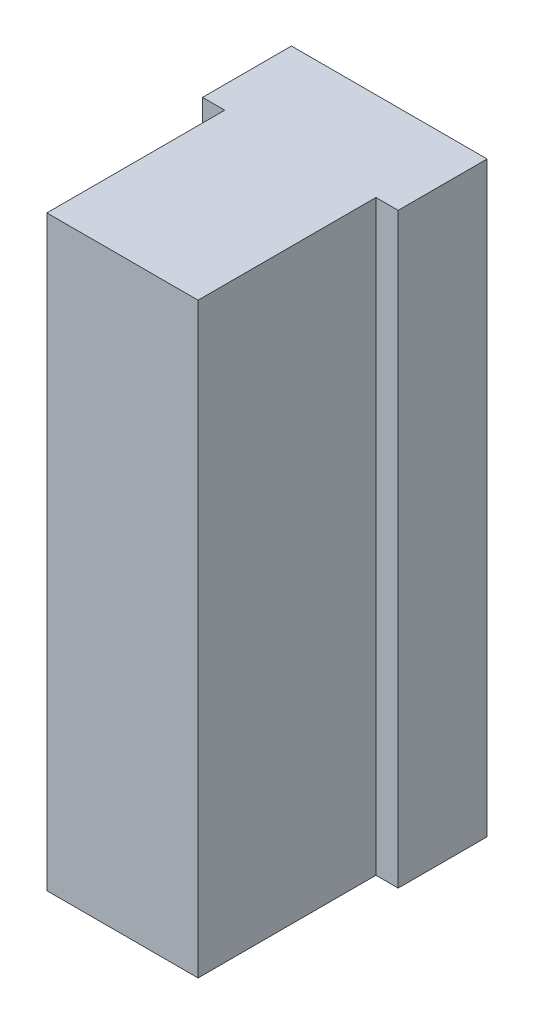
from build123d import *

# Parameters (mm, degrees)
EXTRUDE1_DEPTH = 16.764


with BuildPart() as part:
    # Sketch1 → Extrude1 (new body)
    with BuildSketch(Plane(origin=(0, 0, 0), x_dir=(1, 0, 0), z_dir=(0, 1, 0))):
        Polygon((-3.70970077, 13.314235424), (-3.07470077, 13.314235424), (-3.07470077, 15.854235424), (-8.66270077, 15.854235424), (-8.66270077, 13.314235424), (-8.02770077, 13.314235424), (-8.02770077, 8.234235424), (-3.70970077, 8.234235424), align=None)
    extrude(amount=EXTRUDE1_DEPTH)


solid = part.part
